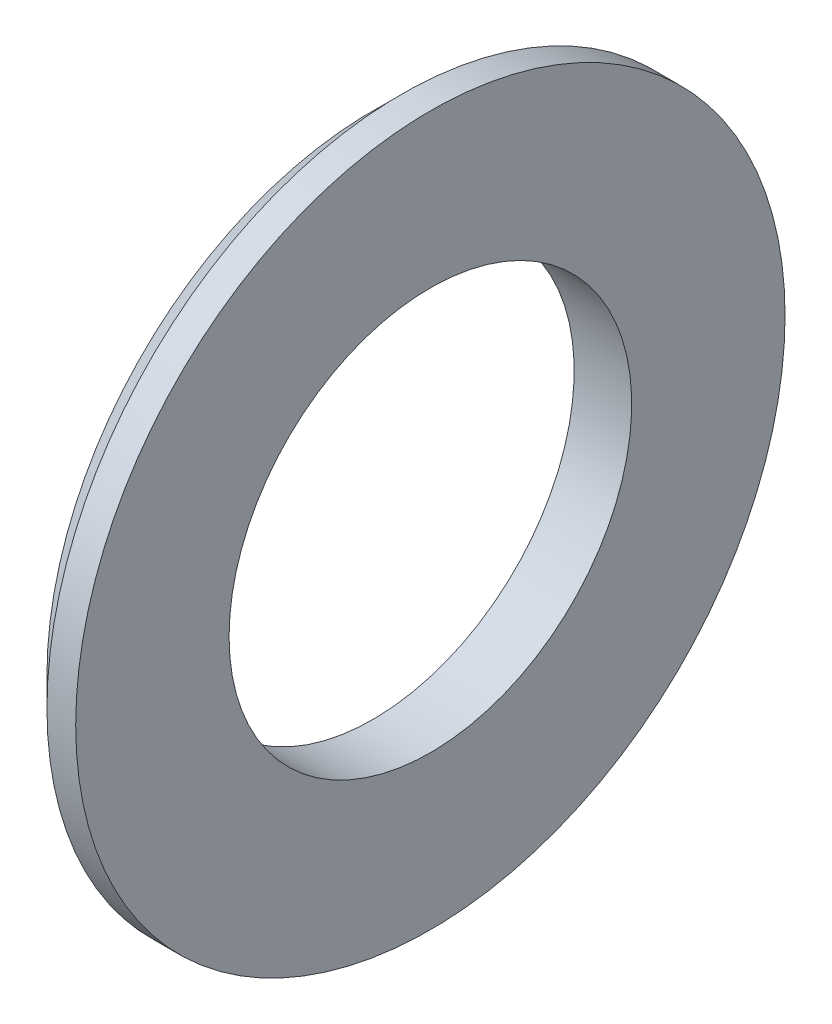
from build123d import *


with BuildPart() as part:
    # Sketch1 → Base-Revolve (revolve)
    with BuildSketch(Plane.XY, mode=Mode.PRIVATE) as base_revolve_sk:
        Polygon((0, 10.5), (0, 18.5), (-1.5, 18.5), (-3, 17), (-3, 10.5), align=None)
    revolve(base_revolve_sk.sketch.rotate(Axis((-34.925, 0, 0), (1, 0, 0)), 90), axis=Axis((-34.925, 0, 0), (1, 0, 0)))


solid = part.part
